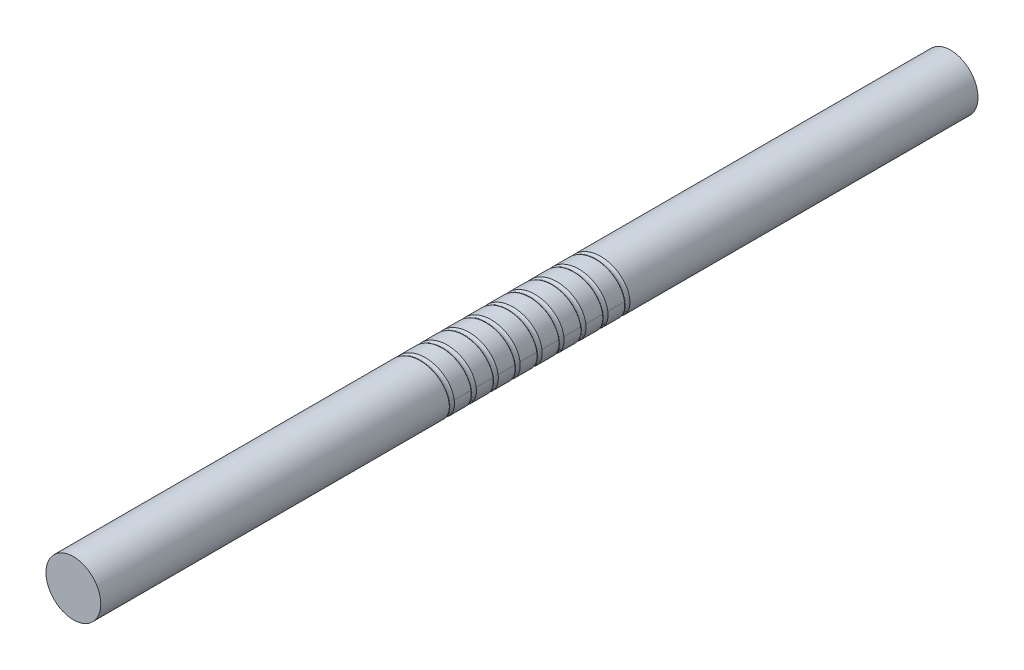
from build123d import *

# Parameters (mm, degrees)
SKETCH1_R              = 25
BOSS_EXTRUDE1_DEPTH    = 800
CUT_SWEEP1_PITCH       = 20
CUT_SWEEP1_HEIGHT      = 180
CUT_SWEEP1_RADIUS      = 27.116666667
CUT_SWEEP1_START_ANGLE = -180
SKETCH3_R              = 3.175


with BuildPart() as part:
    # Sketch1 → Boss-Extrude1 (new body)
    with BuildSketch(Plane.XY):
        Circle(SKETCH1_R)
    extrude(amount=BOSS_EXTRUDE1_DEPTH)

    # Cut-Sweep1: sweep along a helix
    with BuildLine() as cut_sweep1_path:
        add(Helix(CUT_SWEEP1_PITCH, CUT_SWEEP1_HEIGHT, CUT_SWEEP1_RADIUS, center=(0, 0, 310), direction=(0, 0, 1), mode=Mode.PRIVATE).rotate(Axis((0, 0, 310), (0, 0, 1)), CUT_SWEEP1_START_ANGLE))
    # Sketch3 → Cut-Sweep1 (sweep, cut)
    with BuildSketch(Plane(origin=(0, 0, 0), x_dir=(1, 0, 0), z_dir=(0, 1, 0))):
        with Locations((-27.116666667, -310)):
            Circle(SKETCH3_R)
    sweep(path=cut_sweep1_path.line, is_frenet=True, mode=Mode.SUBTRACT)


solid = part.part
